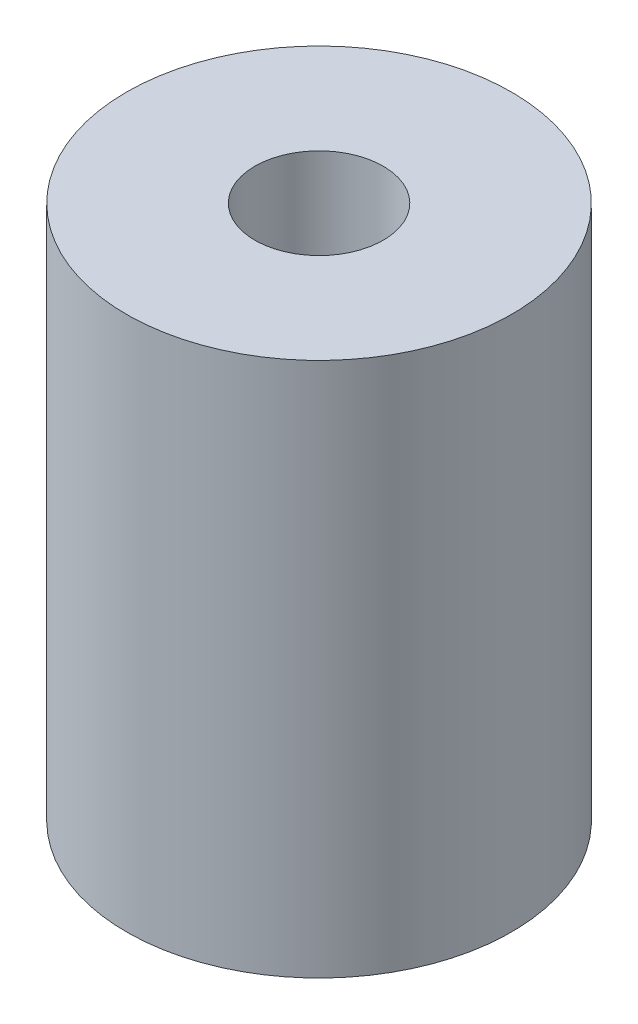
from build123d import *

# Parameters (mm, degrees)
SKETCH1_W = 6
SKETCH1_H = 25


with BuildPart() as part:
    # Sketch1 → Revolve1 (revolve)
    with BuildSketch(Plane.XY, mode=Mode.PRIVATE) as revolve1_sk:
        with Locations((6, 12.5)):
            Rectangle(SKETCH1_W, SKETCH1_H)
    revolve(revolve1_sk.sketch.rotate(Axis((0, 25, 0), (0, -1, 0)), 180), axis=Axis((0, 25, 0), (0, -1, 0)))


solid = part.part
